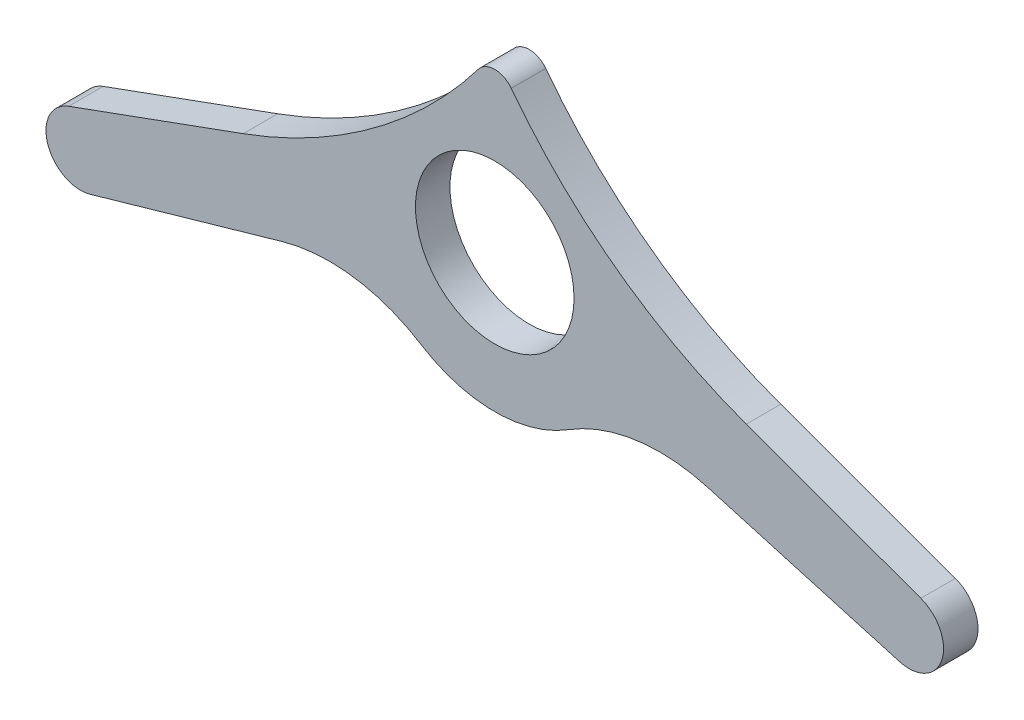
ISO-10303-21;
HEADER;
FILE_DESCRIPTION(('STEP AP214'),'2;1');
FILE_NAME('part.step','',(''),(''),'','','');
FILE_SCHEMA(('AUTOMOTIVE_DESIGN { 1 0 10303 214 1 1 1 1 }'));
ENDSEC;
DATA;
#1=APPLICATION_CONTEXT('core data for automotive mechanical design processes');
#2=APPLICATION_PROTOCOL_DEFINITION('international standard','automotive_design',2000,#1);
#3=PRODUCT_CONTEXT('',#1,'mechanical');
#4=PRODUCT('Part','Part','',(#3));
#5=PRODUCT_RELATED_PRODUCT_CATEGORY('part','',(#4));
#6=PRODUCT_DEFINITION_FORMATION('','',#4);
#7=PRODUCT_DEFINITION_CONTEXT('part definition',#1,'design');
#8=PRODUCT_DEFINITION('design','',#6,#7);
#9=PRODUCT_DEFINITION_SHAPE('','',#8);
#10=(LENGTH_UNIT() NAMED_UNIT(*) SI_UNIT(.MILLI.,.METRE.));
#11=(NAMED_UNIT(*) PLANE_ANGLE_UNIT() SI_UNIT($,.RADIAN.));
#12=(NAMED_UNIT(*) SI_UNIT($,.STERADIAN.) SOLID_ANGLE_UNIT());
#13=UNCERTAINTY_MEASURE_WITH_UNIT(LENGTH_MEASURE(1.E-05),#10,'distance_accuracy_value','');
#14=(GEOMETRIC_REPRESENTATION_CONTEXT(3) GLOBAL_UNCERTAINTY_ASSIGNED_CONTEXT((#13)) GLOBAL_UNIT_ASSIGNED_CONTEXT((#10,
#11,#12)) REPRESENTATION_CONTEXT('',''));
#15=CARTESIAN_POINT('',(0.,0.,0.));
#16=DIRECTION('',(0.,0.,1.));
#17=DIRECTION('',(1.,0.,0.));
#18=AXIS2_PLACEMENT_3D('',#15,#16,#17);
#19=CARTESIAN_POINT('',(-60.0788559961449,-17.2273347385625,5.));
#20=DIRECTION('',(0.,0.,-1.));
#21=DIRECTION('',(-1.,0.,0.));
#22=AXIS2_PLACEMENT_3D('',#19,#20,#21);
#23=CYLINDRICAL_SURFACE('',#22,4.99999999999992);
#24=CARTESIAN_POINT('',(-60.0788559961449,-17.2273347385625,0.));
#25=DIRECTION('',(0.,0.,1.));
#26=DIRECTION('',(1.,0.,0.));
#27=AXIS2_PLACEMENT_3D('',#24,#25,#26);
#28=CIRCLE('',#27,4.99999999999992);
#29=CARTESIAN_POINT('',(-58.7006692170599,-22.0336432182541,0.));
#30=VERTEX_POINT('',#29);
#31=CARTESIAN_POINT('',(-61.7889567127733,-12.5288716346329,0.));
#32=VERTEX_POINT('',#31);
#33=EDGE_CURVE('E174',#30,#32,#28,.F.);
#34=ORIENTED_EDGE('',*,*,#33,.F.);
#35=DIRECTION('',(0.,0.,-1.));
#36=VECTOR('',#35,1.);
#37=CARTESIAN_POINT('',(-58.7006692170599,-22.0336432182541,5.));
#38=LINE('',#37,#36);
#39=CARTESIAN_POINT('',(-58.7006692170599,-22.0336432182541,5.));
#40=VERTEX_POINT('',#39);
#41=EDGE_CURVE('E11',#40,#30,#38,.T.);
#42=ORIENTED_EDGE('',*,*,#41,.F.);
#43=CARTESIAN_POINT('',(-60.0788559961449,-17.2273347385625,5.));
#44=DIRECTION('',(0.,0.,1.));
#45=DIRECTION('',(1.,0.,0.));
#46=AXIS2_PLACEMENT_3D('',#43,#44,#45);
#47=CIRCLE('',#46,4.99999999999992);
#48=CARTESIAN_POINT('',(-61.7889567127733,-12.5288716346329,5.));
#49=VERTEX_POINT('',#48);
#50=EDGE_CURVE('E220',#40,#49,#47,.F.);
#51=ORIENTED_EDGE('',*,*,#50,.T.);
#52=DIRECTION('',(0.,0.,-1.));
#53=VECTOR('',#52,1.);
#54=CARTESIAN_POINT('',(-61.7889567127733,-12.5288716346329,5.));
#55=LINE('',#54,#53);
#56=EDGE_CURVE('E64',#49,#32,#55,.T.);
#57=ORIENTED_EDGE('',*,*,#56,.T.);
#58=EDGE_LOOP('',(#34,#42,#51,#57));
#59=FACE_BOUND('',#58,.T.);
#60=ADVANCED_FACE('F47',(#59),#23,.T.);
#61=CARTESIAN_POINT('',(1.378186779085,-4.80630847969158,5.));
#62=DIRECTION('',(-0.275637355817,0.961261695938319,0.));
#63=DIRECTION('',(-0.961261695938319,-0.275637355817,0.));
#64=AXIS2_PLACEMENT_3D('',#61,#62,#63);
#65=PLANE('',#64);
#66=DIRECTION('',(0.961261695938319,0.275637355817,0.));
#67=VECTOR('',#66,1.);
#68=CARTESIAN_POINT('',(1.378186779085,-4.80630847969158,0.));
#69=LINE('',#68,#67);
#70=CARTESIAN_POINT('',(-30.8635106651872,-14.0514664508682,0.));
#71=VERTEX_POINT('',#70);
#72=EDGE_CURVE('E177',#30,#71,#69,.T.);
#73=ORIENTED_EDGE('',*,*,#72,.T.);
#74=DIRECTION('',(0.,0.,-1.));
#75=VECTOR('',#74,1.);
#76=CARTESIAN_POINT('',(-30.8635106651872,-14.0514664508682,5.));
#77=LINE('',#76,#75);
#78=CARTESIAN_POINT('',(-30.8635106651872,-14.0514664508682,5.));
#79=VERTEX_POINT('',#78);
#80=EDGE_CURVE('E56',#79,#71,#77,.T.);
#81=ORIENTED_EDGE('',*,*,#80,.F.);
#82=DIRECTION('',(0.961261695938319,0.275637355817,0.));
#83=VECTOR('',#82,1.);
#84=CARTESIAN_POINT('',(1.378186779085,-4.80630847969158,5.));
#85=LINE('',#84,#83);
#86=EDGE_CURVE('E275',#40,#79,#85,.T.);
#87=ORIENTED_EDGE('',*,*,#86,.F.);
#88=ORIENTED_EDGE('',*,*,#41,.T.);
#89=EDGE_LOOP('',(#73,#81,#87,#88));
#90=FACE_BOUND('',#89,.T.);
#91=ADVANCED_FACE('F305',(#90),#65,.F.);
#92=CARTESIAN_POINT('',(-23.9725767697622,-38.0830088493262,5.));
#93=DIRECTION('',(0.,0.,-1.));
#94=DIRECTION('',(-1.,0.,0.));
#95=AXIS2_PLACEMENT_3D('',#92,#93,#94);
#96=CYLINDRICAL_SURFACE('',#95,25.);
#97=CARTESIAN_POINT('',(-23.9725767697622,-38.0830088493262,0.));
#98=DIRECTION('',(0.,0.,1.));
#99=DIRECTION('',(1.,0.,0.));
#100=AXIS2_PLACEMENT_3D('',#97,#98,#99);
#101=CIRCLE('',#100,25.);
#102=CARTESIAN_POINT('',(-10.6544785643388,-16.9257817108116,0.));
#103=VERTEX_POINT('',#102);
#104=EDGE_CURVE('E180',#71,#103,#101,.F.);
#105=ORIENTED_EDGE('',*,*,#104,.T.);
#106=DIRECTION('',(0.,0.,-1.));
#107=VECTOR('',#106,1.);
#108=CARTESIAN_POINT('',(-10.6544785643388,-16.9257817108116,5.));
#109=LINE('',#108,#107);
#110=CARTESIAN_POINT('',(-10.6544785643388,-16.9257817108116,5.));
#111=VERTEX_POINT('',#110);
#112=EDGE_CURVE('E243',#111,#103,#109,.T.);
#113=ORIENTED_EDGE('',*,*,#112,.F.);
#114=CARTESIAN_POINT('',(-23.9725767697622,-38.0830088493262,5.));
#115=DIRECTION('',(0.,0.,1.));
#116=DIRECTION('',(1.,0.,0.));
#117=AXIS2_PLACEMENT_3D('',#114,#115,#116);
#118=CIRCLE('',#117,25.);
#119=EDGE_CURVE('E253',#79,#111,#118,.F.);
#120=ORIENTED_EDGE('',*,*,#119,.F.);
#121=ORIENTED_EDGE('',*,*,#80,.T.);
#122=EDGE_LOOP('',(#105,#113,#120,#121));
#123=FACE_BOUND('',#122,.T.);
#124=ADVANCED_FACE('F251',(#123),#96,.F.);
#125=CARTESIAN_POINT('',(0.,0.,5.));
#126=DIRECTION('',(0.,0.,-1.));
#127=DIRECTION('',(-1.,0.,0.));
#128=AXIS2_PLACEMENT_3D('',#125,#126,#127);
#129=CYLINDRICAL_SURFACE('',#128,20.);
#130=CARTESIAN_POINT('',(0.,0.,0.));
#131=DIRECTION('',(0.,0.,1.));
#132=DIRECTION('',(1.,0.,0.));
#133=AXIS2_PLACEMENT_3D('',#130,#131,#132);
#134=CIRCLE('',#133,20.);
#135=CARTESIAN_POINT('',(10.6544785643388,-16.9257817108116,0.));
#136=VERTEX_POINT('',#135);
#137=EDGE_CURVE('E184',#136,#103,#134,.F.);
#138=ORIENTED_EDGE('',*,*,#137,.F.);
#139=DIRECTION('',(0.,0.,-1.));
#140=VECTOR('',#139,1.);
#141=CARTESIAN_POINT('',(10.6544785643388,-16.9257817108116,5.));
#142=LINE('',#141,#140);
#143=CARTESIAN_POINT('',(10.6544785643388,-16.9257817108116,5.));
#144=VERTEX_POINT('',#143);
#145=EDGE_CURVE('E240',#144,#136,#142,.T.);
#146=ORIENTED_EDGE('',*,*,#145,.F.);
#147=CARTESIAN_POINT('',(0.,0.,5.));
#148=DIRECTION('',(0.,0.,1.));
#149=DIRECTION('',(1.,0.,0.));
#150=AXIS2_PLACEMENT_3D('',#147,#148,#149);
#151=CIRCLE('',#150,20.);
#152=EDGE_CURVE('E265',#144,#111,#151,.F.);
#153=ORIENTED_EDGE('',*,*,#152,.T.);
#154=ORIENTED_EDGE('',*,*,#112,.T.);
#155=EDGE_LOOP('',(#138,#146,#153,#154));
#156=FACE_BOUND('',#155,.T.);
#157=ADVANCED_FACE('F262',(#156),#129,.T.);
#158=CARTESIAN_POINT('',(23.9725767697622,-38.0830088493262,5.));
#159=DIRECTION('',(0.,0.,-1.));
#160=DIRECTION('',(-1.,0.,0.));
#161=AXIS2_PLACEMENT_3D('',#158,#159,#160);
#162=CYLINDRICAL_SURFACE('',#161,25.);
#163=CARTESIAN_POINT('',(23.9725767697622,-38.0830088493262,0.));
#164=DIRECTION('',(0.,0.,1.));
#165=DIRECTION('',(1.,0.,0.));
#166=AXIS2_PLACEMENT_3D('',#163,#164,#165);
#167=CIRCLE('',#166,25.);
#168=CARTESIAN_POINT('',(30.8635106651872,-14.0514664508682,0.));
#169=VERTEX_POINT('',#168);
#170=EDGE_CURVE('E188',#169,#136,#167,.T.);
#171=ORIENTED_EDGE('',*,*,#170,.F.);
#172=DIRECTION('',(0.,0.,-1.));
#173=VECTOR('',#172,1.);
#174=CARTESIAN_POINT('',(30.8635106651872,-14.0514664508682,5.));
#175=LINE('',#174,#173);
#176=CARTESIAN_POINT('',(30.8635106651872,-14.0514664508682,5.));
#177=VERTEX_POINT('',#176);
#178=EDGE_CURVE('E237',#177,#169,#175,.T.);
#179=ORIENTED_EDGE('',*,*,#178,.F.);
#180=CARTESIAN_POINT('',(23.9725767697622,-38.0830088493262,5.));
#181=DIRECTION('',(0.,0.,1.));
#182=DIRECTION('',(1.,0.,0.));
#183=AXIS2_PLACEMENT_3D('',#180,#181,#182);
#184=CIRCLE('',#183,25.);
#185=EDGE_CURVE('E269',#177,#144,#184,.T.);
#186=ORIENTED_EDGE('',*,*,#185,.T.);
#187=ORIENTED_EDGE('',*,*,#145,.T.);
#188=EDGE_LOOP('',(#171,#179,#186,#187));
#189=FACE_BOUND('',#188,.T.);
#190=ADVANCED_FACE('F316',(#189),#162,.F.);
#191=CARTESIAN_POINT('',(-1.378186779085,-4.80630847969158,5.));
#192=DIRECTION('',(-0.275637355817,-0.961261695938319,0.));
#193=DIRECTION('',(0.961261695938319,-0.275637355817,0.));
#194=AXIS2_PLACEMENT_3D('',#191,#192,#193);
#195=PLANE('',#194);
#196=DIRECTION('',(-0.961261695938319,0.275637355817,0.));
#197=VECTOR('',#196,1.);
#198=CARTESIAN_POINT('',(-1.378186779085,-4.80630847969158,0.));
#199=LINE('',#198,#197);
#200=CARTESIAN_POINT('',(58.7006692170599,-22.0336432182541,0.));
#201=VERTEX_POINT('',#200);
#202=EDGE_CURVE('E192',#201,#169,#199,.T.);
#203=ORIENTED_EDGE('',*,*,#202,.F.);
#204=DIRECTION('',(0.,0.,-1.));
#205=VECTOR('',#204,1.);
#206=CARTESIAN_POINT('',(58.7006692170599,-22.0336432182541,5.));
#207=LINE('',#206,#205);
#208=CARTESIAN_POINT('',(58.7006692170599,-22.0336432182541,5.));
#209=VERTEX_POINT('',#208);
#210=EDGE_CURVE('E234',#209,#201,#207,.T.);
#211=ORIENTED_EDGE('',*,*,#210,.F.);
#212=DIRECTION('',(-0.961261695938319,0.275637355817,0.));
#213=VECTOR('',#212,1.);
#214=CARTESIAN_POINT('',(-1.378186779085,-4.80630847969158,5.));
#215=LINE('',#214,#213);
#216=EDGE_CURVE('E273',#209,#177,#215,.T.);
#217=ORIENTED_EDGE('',*,*,#216,.T.);
#218=ORIENTED_EDGE('',*,*,#178,.T.);
#219=EDGE_LOOP('',(#203,#211,#217,#218));
#220=FACE_BOUND('',#219,.T.);
#221=ADVANCED_FACE('F319',(#220),#195,.T.);
#222=CARTESIAN_POINT('',(60.0788559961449,-17.2273347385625,5.));
#223=DIRECTION('',(0.,0.,-1.));
#224=DIRECTION('',(-1.,0.,0.));
#225=AXIS2_PLACEMENT_3D('',#222,#223,#224);
#226=CYLINDRICAL_SURFACE('',#225,4.99999999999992);
#227=CARTESIAN_POINT('',(60.0788559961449,-17.2273347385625,0.));
#228=DIRECTION('',(0.,0.,1.));
#229=DIRECTION('',(1.,0.,0.));
#230=AXIS2_PLACEMENT_3D('',#227,#228,#229);
#231=CIRCLE('',#230,4.99999999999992);
#232=CARTESIAN_POINT('',(61.7889567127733,-12.5288716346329,0.));
#233=VERTEX_POINT('',#232);
#234=EDGE_CURVE('E196',#201,#233,#231,.T.);
#235=ORIENTED_EDGE('',*,*,#234,.T.);
#236=DIRECTION('',(0.,0.,-1.));
#237=VECTOR('',#236,1.);
#238=CARTESIAN_POINT('',(61.7889567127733,-12.5288716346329,5.));
#239=LINE('',#238,#237);
#240=CARTESIAN_POINT('',(61.7889567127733,-12.5288716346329,5.));
#241=VERTEX_POINT('',#240);
#242=EDGE_CURVE('E230',#241,#233,#239,.T.);
#243=ORIENTED_EDGE('',*,*,#242,.F.);
#244=CARTESIAN_POINT('',(60.0788559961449,-17.2273347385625,5.));
#245=DIRECTION('',(0.,0.,1.));
#246=DIRECTION('',(1.,0.,0.));
#247=AXIS2_PLACEMENT_3D('',#244,#245,#246);
#248=CIRCLE('',#247,4.99999999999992);
#249=EDGE_CURVE('E282',#209,#241,#248,.T.);
#250=ORIENTED_EDGE('',*,*,#249,.F.);
#251=ORIENTED_EDGE('',*,*,#210,.T.);
#252=EDGE_LOOP('',(#235,#243,#250,#251));
#253=FACE_BOUND('',#252,.T.);
#254=ADVANCED_FACE('F323',(#253),#226,.T.);
#255=CARTESIAN_POINT('',(3.20123316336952,8.79531583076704,5.));
#256=DIRECTION('',(-0.342020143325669,-0.939692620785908,0.));
#257=DIRECTION('',(0.939692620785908,-0.342020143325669,0.));
#258=AXIS2_PLACEMENT_3D('',#255,#256,#257);
#259=PLANE('',#258);
#260=DIRECTION('',(-0.939692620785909,0.342020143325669,0.));
#261=VECTOR('',#260,1.);
#262=CARTESIAN_POINT('',(3.20123316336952,8.79531583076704,0.));
#263=LINE('',#262,#261);
#264=CARTESIAN_POINT('',(36.4758895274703,-3.3156686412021,0.));
#265=VERTEX_POINT('',#264);
#266=EDGE_CURVE('E199',#233,#265,#263,.T.);
#267=ORIENTED_EDGE('',*,*,#266,.T.);
#268=DIRECTION('',(0.,0.,-1.));
#269=VECTOR('',#268,1.);
#270=CARTESIAN_POINT('',(36.4758895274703,-3.3156686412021,5.));
#271=LINE('',#270,#269);
#272=CARTESIAN_POINT('',(36.4758895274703,-3.3156686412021,5.));
#273=VERTEX_POINT('',#272);
#274=EDGE_CURVE('E227',#273,#265,#271,.T.);
#275=ORIENTED_EDGE('',*,*,#274,.F.);
#276=DIRECTION('',(-0.939692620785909,0.342020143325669,0.));
#277=VECTOR('',#276,1.);
#278=CARTESIAN_POINT('',(3.20123316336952,8.79531583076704,5.));
#279=LINE('',#278,#277);
#280=EDGE_CURVE('E285',#241,#273,#279,.T.);
#281=ORIENTED_EDGE('',*,*,#280,.F.);
#282=ORIENTED_EDGE('',*,*,#242,.T.);
#283=EDGE_LOOP('',(#267,#275,#281,#282));
#284=FACE_BOUND('',#283,.T.);
#285=ADVANCED_FACE('F327',(#284),#259,.F.);
#286=CARTESIAN_POINT('',(62.1274002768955,67.161277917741,5.));
#287=DIRECTION('',(0.,0.,-1.));
#288=DIRECTION('',(-1.,0.,0.));
#289=AXIS2_PLACEMENT_3D('',#286,#287,#288);
#290=CYLINDRICAL_SURFACE('',#289,75.);
#291=CARTESIAN_POINT('',(62.1274002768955,67.161277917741,0.));
#292=DIRECTION('',(0.,0.,1.));
#293=DIRECTION('',(1.,0.,0.));
#294=AXIS2_PLACEMENT_3D('',#291,#292,#293);
#295=CIRCLE('',#294,75.);
#296=CARTESIAN_POINT('',(2.38951539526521,21.8138953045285,0.));
#297=VERTEX_POINT('',#296);
#298=EDGE_CURVE('E203',#297,#265,#295,.T.);
#299=ORIENTED_EDGE('',*,*,#298,.F.);
#300=DIRECTION('',(0.,0.,-1.));
#301=VECTOR('',#300,1.);
#302=CARTESIAN_POINT('',(2.38951539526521,21.8138953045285,5.));
#303=LINE('',#302,#301);
#304=CARTESIAN_POINT('',(2.38951539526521,21.8138953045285,5.));
#305=VERTEX_POINT('',#304);
#306=EDGE_CURVE('E160',#305,#297,#303,.T.);
#307=ORIENTED_EDGE('',*,*,#306,.F.);
#308=CARTESIAN_POINT('',(62.1274002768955,67.161277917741,5.));
#309=DIRECTION('',(0.,0.,1.));
#310=DIRECTION('',(1.,0.,0.));
#311=AXIS2_PLACEMENT_3D('',#308,#309,#310);
#312=CIRCLE('',#311,75.);
#313=EDGE_CURVE('E148',#305,#273,#312,.T.);
#314=ORIENTED_EDGE('',*,*,#313,.T.);
#315=ORIENTED_EDGE('',*,*,#274,.T.);
#316=EDGE_LOOP('',(#299,#307,#314,#315));
#317=FACE_BOUND('',#316,.T.);
#318=ADVANCED_FACE('F290',(#317),#290,.F.);
#319=CARTESIAN_POINT('',(0.,20.,5.));
#320=DIRECTION('',(0.,0.,-1.));
#321=DIRECTION('',(-1.,0.,0.));
#322=AXIS2_PLACEMENT_3D('',#319,#320,#321);
#323=CYLINDRICAL_SURFACE('',#322,3.);
#324=CARTESIAN_POINT('',(0.,20.,0.));
#325=DIRECTION('',(0.,0.,1.));
#326=DIRECTION('',(1.,0.,0.));
#327=AXIS2_PLACEMENT_3D('',#324,#325,#326);
#328=CIRCLE('',#327,3.);
#329=CARTESIAN_POINT('',(-2.38951539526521,21.8138953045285,0.));
#330=VERTEX_POINT('',#329);
#331=EDGE_CURVE('E156',#297,#330,#328,.T.);
#332=ORIENTED_EDGE('',*,*,#331,.T.);
#333=DIRECTION('',(0.,0.,-1.));
#334=VECTOR('',#333,1.);
#335=CARTESIAN_POINT('',(-2.38951539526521,21.8138953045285,5.));
#336=LINE('',#335,#334);
#337=CARTESIAN_POINT('',(-2.38951539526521,21.8138953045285,5.));
#338=VERTEX_POINT('',#337);
#339=EDGE_CURVE('E153',#338,#330,#336,.T.);
#340=ORIENTED_EDGE('',*,*,#339,.F.);
#341=CARTESIAN_POINT('',(0.,20.,5.));
#342=DIRECTION('',(0.,0.,1.));
#343=DIRECTION('',(1.,0.,0.));
#344=AXIS2_PLACEMENT_3D('',#341,#342,#343);
#345=CIRCLE('',#344,3.);
#346=EDGE_CURVE('E139',#305,#338,#345,.T.);
#347=ORIENTED_EDGE('',*,*,#346,.F.);
#348=ORIENTED_EDGE('',*,*,#306,.T.);
#349=EDGE_LOOP('',(#332,#340,#347,#348));
#350=FACE_BOUND('',#349,.T.);
#351=ADVANCED_FACE('F154',(#350),#323,.T.);
#352=CARTESIAN_POINT('',(-62.1274002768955,67.161277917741,5.));
#353=DIRECTION('',(0.,0.,-1.));
#354=DIRECTION('',(-1.,0.,0.));
#355=AXIS2_PLACEMENT_3D('',#352,#353,#354);
#356=CYLINDRICAL_SURFACE('',#355,75.);
#357=CARTESIAN_POINT('',(-62.1274002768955,67.161277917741,0.));
#358=DIRECTION('',(0.,0.,1.));
#359=DIRECTION('',(1.,0.,0.));
#360=AXIS2_PLACEMENT_3D('',#357,#358,#359);
#361=CIRCLE('',#360,75.);
#362=CARTESIAN_POINT('',(-36.4758895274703,-3.3156686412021,0.));
#363=VERTEX_POINT('',#362);
#364=EDGE_CURVE('E209',#330,#363,#361,.F.);
#365=ORIENTED_EDGE('',*,*,#364,.T.);
#366=DIRECTION('',(0.,0.,-1.));
#367=VECTOR('',#366,1.);
#368=CARTESIAN_POINT('',(-36.4758895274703,-3.3156686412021,5.));
#369=LINE('',#368,#367);
#370=CARTESIAN_POINT('',(-36.4758895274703,-3.3156686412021,5.));
#371=VERTEX_POINT('',#370);
#372=EDGE_CURVE('E102',#371,#363,#369,.T.);
#373=ORIENTED_EDGE('',*,*,#372,.F.);
#374=CARTESIAN_POINT('',(-62.1274002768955,67.161277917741,5.));
#375=DIRECTION('',(0.,0.,1.));
#376=DIRECTION('',(1.,0.,0.));
#377=AXIS2_PLACEMENT_3D('',#374,#375,#376);
#378=CIRCLE('',#377,75.);
#379=EDGE_CURVE('E146',#338,#371,#378,.F.);
#380=ORIENTED_EDGE('',*,*,#379,.F.);
#381=ORIENTED_EDGE('',*,*,#339,.T.);
#382=EDGE_LOOP('',(#365,#373,#380,#381));
#383=FACE_BOUND('',#382,.T.);
#384=ADVANCED_FACE('F162',(#383),#356,.F.);
#385=CARTESIAN_POINT('',(-3.20123316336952,8.79531583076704,5.));
#386=DIRECTION('',(-0.342020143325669,0.939692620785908,0.));
#387=DIRECTION('',(-0.939692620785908,-0.342020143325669,0.));
#388=AXIS2_PLACEMENT_3D('',#385,#386,#387);
#389=PLANE('',#388);
#390=DIRECTION('',(0.939692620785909,0.342020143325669,0.));
#391=VECTOR('',#390,1.);
#392=CARTESIAN_POINT('',(-3.20123316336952,8.79531583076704,0.));
#393=LINE('',#392,#391);
#394=EDGE_CURVE('E212',#32,#363,#393,.T.);
#395=ORIENTED_EDGE('',*,*,#394,.F.);
#396=ORIENTED_EDGE('',*,*,#56,.F.);
#397=DIRECTION('',(0.939692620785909,0.342020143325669,0.));
#398=VECTOR('',#397,1.);
#399=CARTESIAN_POINT('',(-3.20123316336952,8.79531583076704,5.));
#400=LINE('',#399,#398);
#401=EDGE_CURVE('E164',#49,#371,#400,.T.);
#402=ORIENTED_EDGE('',*,*,#401,.T.);
#403=ORIENTED_EDGE('',*,*,#372,.T.);
#404=EDGE_LOOP('',(#395,#396,#402,#403));
#405=FACE_BOUND('',#404,.T.);
#406=ADVANCED_FACE('F293',(#405),#389,.T.);
#407=CARTESIAN_POINT('',(0.,0.,5.));
#408=DIRECTION('',(0.,0.,-1.));
#409=DIRECTION('',(-1.,0.,0.));
#410=AXIS2_PLACEMENT_3D('',#407,#408,#409);
#411=CYLINDRICAL_SURFACE('',#410,11.5);
#412=CARTESIAN_POINT('',(0.,0.,5.));
#413=DIRECTION('',(0.,0.,1.));
#414=DIRECTION('',(1.,0.,0.));
#415=AXIS2_PLACEMENT_3D('',#412,#413,#414);
#416=CIRCLE('',#415,11.5);
#417=CARTESIAN_POINT('',(11.5,0.,5.));
#418=VERTEX_POINT('',#417);
#419=EDGE_CURVE('E167',#418,#418,#416,.T.);
#420=ORIENTED_EDGE('',*,*,#419,.T.);
#421=EDGE_LOOP('',(#420));
#422=FACE_BOUND('',#421,.T.);
#423=CARTESIAN_POINT('',(0.,0.,0.));
#424=DIRECTION('',(0.,0.,1.));
#425=DIRECTION('',(1.,0.,0.));
#426=AXIS2_PLACEMENT_3D('',#423,#424,#425);
#427=CIRCLE('',#426,11.5);
#428=CARTESIAN_POINT('',(11.5,0.,0.));
#429=VERTEX_POINT('',#428);
#430=EDGE_CURVE('E216',#429,#429,#427,.T.);
#431=ORIENTED_EDGE('',*,*,#430,.F.);
#432=EDGE_LOOP('',(#431));
#433=FACE_BOUND('',#432,.T.);
#434=ADVANCED_FACE('F295',(#422,#433),#411,.F.);
#435=CARTESIAN_POINT('',(0.,0.,5.));
#436=DIRECTION('',(0.,0.,1.));
#437=DIRECTION('',(1.,0.,0.));
#438=AXIS2_PLACEMENT_3D('',#435,#436,#437);
#439=PLANE('',#438);
#440=ORIENTED_EDGE('',*,*,#50,.F.);
#441=ORIENTED_EDGE('',*,*,#86,.T.);
#442=ORIENTED_EDGE('',*,*,#119,.T.);
#443=ORIENTED_EDGE('',*,*,#152,.F.);
#444=ORIENTED_EDGE('',*,*,#185,.F.);
#445=ORIENTED_EDGE('',*,*,#216,.F.);
#446=ORIENTED_EDGE('',*,*,#249,.T.);
#447=ORIENTED_EDGE('',*,*,#280,.T.);
#448=ORIENTED_EDGE('',*,*,#313,.F.);
#449=ORIENTED_EDGE('',*,*,#346,.T.);
#450=ORIENTED_EDGE('',*,*,#379,.T.);
#451=ORIENTED_EDGE('',*,*,#401,.F.);
#452=EDGE_LOOP('',(#440,#441,#442,#443,#444,#445,#446,#447,#448,#449,#450,#451));
#453=FACE_BOUND('',#452,.T.);
#454=ORIENTED_EDGE('',*,*,#419,.F.);
#455=EDGE_LOOP('',(#454));
#456=FACE_BOUND('',#455,.T.);
#457=ADVANCED_FACE('F142',(#453,#456),#439,.T.);
#458=CARTESIAN_POINT('',(0.,0.,0.));
#459=DIRECTION('',(0.,0.,1.));
#460=DIRECTION('',(1.,0.,0.));
#461=AXIS2_PLACEMENT_3D('',#458,#459,#460);
#462=PLANE('',#461);
#463=ORIENTED_EDGE('',*,*,#33,.T.);
#464=ORIENTED_EDGE('',*,*,#394,.T.);
#465=ORIENTED_EDGE('',*,*,#364,.F.);
#466=ORIENTED_EDGE('',*,*,#331,.F.);
#467=ORIENTED_EDGE('',*,*,#298,.T.);
#468=ORIENTED_EDGE('',*,*,#266,.F.);
#469=ORIENTED_EDGE('',*,*,#234,.F.);
#470=ORIENTED_EDGE('',*,*,#202,.T.);
#471=ORIENTED_EDGE('',*,*,#170,.T.);
#472=ORIENTED_EDGE('',*,*,#137,.T.);
#473=ORIENTED_EDGE('',*,*,#104,.F.);
#474=ORIENTED_EDGE('',*,*,#72,.F.);
#475=EDGE_LOOP('',(#463,#464,#465,#466,#467,#468,#469,#470,#471,#472,#473,#474));
#476=FACE_BOUND('',#475,.T.);
#477=ORIENTED_EDGE('',*,*,#430,.T.);
#478=EDGE_LOOP('',(#477));
#479=FACE_BOUND('',#478,.T.);
#480=ADVANCED_FACE('F257',(#476,#479),#462,.F.);
#481=CLOSED_SHELL('',(#60,#91,#124,#157,#190,#221,#254,#285,#318,#351,#384,#406,#434,#457,#480));
#482=MANIFOLD_SOLID_BREP('B2',#481);
#483=ADVANCED_BREP_SHAPE_REPRESENTATION('',(#18,#482),#14);
#484=SHAPE_DEFINITION_REPRESENTATION(#9,#483);
ENDSEC;
END-ISO-10303-21;
